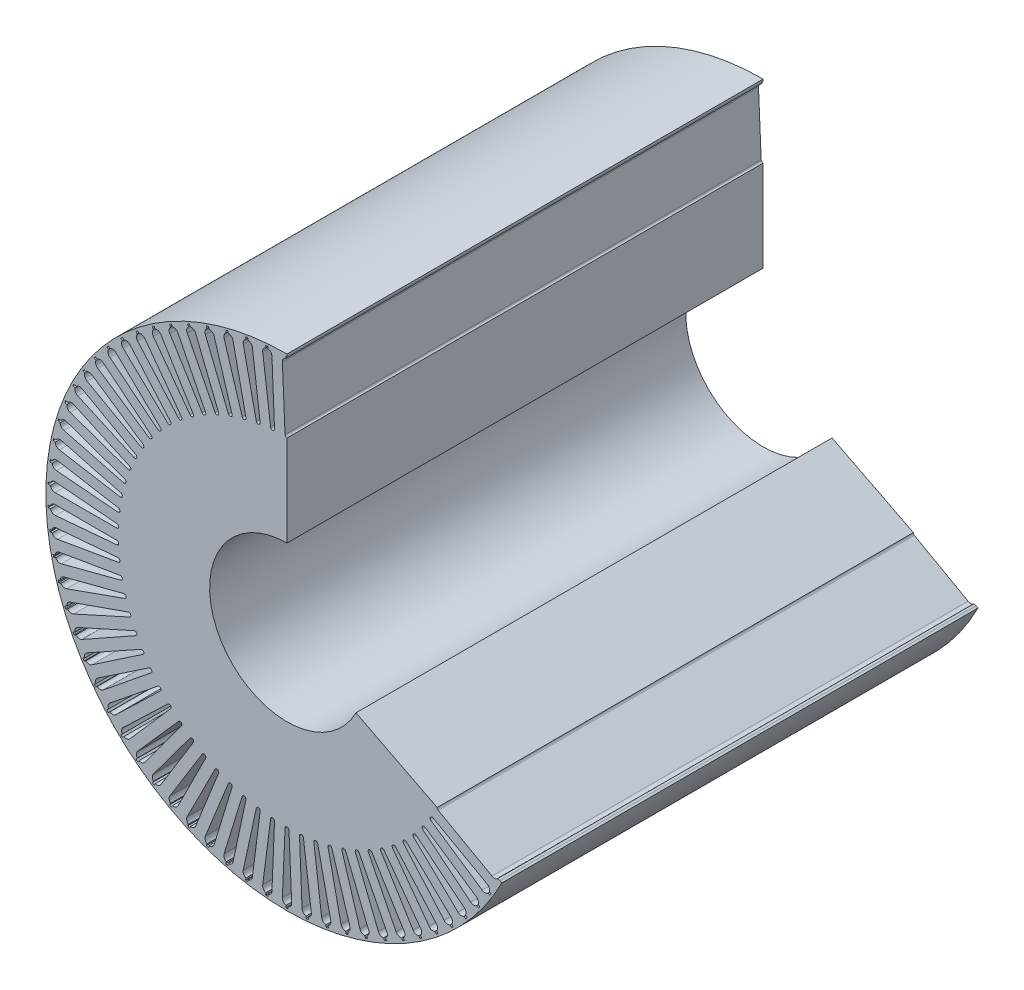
from build123d import *

# Parameters (mm, degrees)
SKICA1_R                 = 25
P_IDAT_VYSUNUT_M1_DEPTH  = 153.8
M_TKO1_SCALE             = 0.655
ODEBRAT_VYSUNUT_M1_DEPTH = 124.916687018


with BuildPart() as part:
    # Skica1 → P_idat vysunut_m1 (new body)
    with BuildSketch(Plane.XY):
        with BuildLine():
            ThreePointArc((77.9, 0), (55.083618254, 55.083618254), (0, 77.9))
            ThreePointArc((0, 77.9), (-55.083618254, -55.083618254), (77.9, 0))
        make_face()
        with BuildLine():
            ThreePointArc((-45.890654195, -59.220598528), (-45.928525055, -59.274358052), (-45.968708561, -59.326411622))
            ThreePointArc((-45.968708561, -59.326411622), (-46.805919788, -59.848414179), (-47.786517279, -59.739612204))
            Line((-47.786517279, -59.739612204), (-48.226271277, -60.284237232))
            Line((-48.226271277, -60.284237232), (-48.770896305, -59.844483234))
            Line((-48.770896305, -59.844483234), (-48.331142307, -59.299858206))
            ThreePointArc((-48.331142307, -59.299858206), (-48.644093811, -58.364192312), (-48.310190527, -57.435796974))
            ThreePointArc((-48.310190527, -57.435796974), (-48.267771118, -57.385548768), (-48.22319682, -57.337201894))
            Line((-48.22319682, -57.337201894), (-35.064014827, -42.42312779))
            ThreePointArc((-35.064014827, -42.42312779), (-34.178073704, -42.328743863), (-34.083689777, -43.214684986))
            Line((-34.083689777, -43.214684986), (-45.890654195, -59.220598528))
        make_face(mode=Mode.SUBTRACT)
        with BuildLine():
            ThreePointArc((-55.238888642, -50.613205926), (-55.285300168, -50.659791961), (-55.333702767, -50.704305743))
            ThreePointArc((-55.333702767, -50.704305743), (-56.247090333, -51.077310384), (-57.195195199, -50.804351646))
            Line((-57.195195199, -50.804351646), (-57.720665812, -51.266823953))
            Line((-57.720665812, -51.266823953), (-58.183138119, -50.741353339))
            Line((-58.183138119, -50.741353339), (-57.657667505, -50.278881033))
            ThreePointArc((-57.657667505, -50.278881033), (-57.807989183, -49.30378478), (-57.321989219, -48.445173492))
            ThreePointArc((-57.321989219, -48.445173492), (-57.271687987, -48.402816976), (-57.219584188, -48.36269862))
            Line((-57.219584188, -48.36269862), (-41.729194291, -35.887062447))
            ThreePointArc((-41.729194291, -35.887062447), (-40.840045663, -35.943760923), (-40.89674414, -36.832909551))
            Line((-40.89674414, -36.832909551), (-55.238888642, -50.613205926))
        make_face(mode=Mode.SUBTRACT)
        with BuildLine():
            ThreePointArc((-59.332189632, -45.746286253), (-59.382384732, -45.788768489), (-59.434387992, -45.829017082))
            ThreePointArc((-59.434387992, -45.829017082), (-60.376118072, -46.123217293), (-61.297658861, -45.770836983))
            Line((-61.297658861, -45.770836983), (-61.860456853, -46.187080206))
            Line((-61.860456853, -46.187080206), (-62.276700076, -45.624282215))
            Line((-62.276700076, -45.624282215), (-61.713902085, -45.208038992))
            ThreePointArc((-61.713902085, -45.208038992), (-61.780988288, -44.223707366), (-61.223923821, -43.409404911))
            ThreePointArc((-61.223923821, -43.409404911), (-61.170211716, -43.371466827), (-61.114893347, -43.335911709))
            Line((-61.114893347, -43.335911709), (-44.622299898, -32.218895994))
            ThreePointArc((-44.622299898, -32.218895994), (-43.741162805, -32.350795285), (-43.873062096, -33.231932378))
            Line((-43.873062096, -33.231932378), (-59.332189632, -45.746286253))
        make_face(mode=Mode.SUBTRACT)
        with BuildLine():
            ThreePointArc((-50.747590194, -55.11545629), (-50.78988375, -55.16581047), (-50.834336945, -55.214268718))
            ThreePointArc((-50.834336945, -55.214268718), (-51.712801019, -55.663390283), (-52.680638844, -55.471819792))
            Line((-52.680638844, -55.471819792), (-53.164996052, -55.977189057))
            Line((-53.164996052, -55.977189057), (-53.670365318, -55.492831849))
            Line((-53.670365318, -55.492831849), (-53.18600811, -54.987462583))
            ThreePointArc((-53.18600811, -54.987462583), (-53.418482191, -54.028627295), (-53.007048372, -53.131893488))
            ThreePointArc((-53.007048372, -53.131893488), (-52.960520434, -53.08542372), (-52.912006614, -53.04103118))
            Line((-52.912006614, -53.04103118), (-38.535428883, -39.296661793))
            ThreePointArc((-38.535428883, -39.296661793), (-37.644675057, -39.277750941), (-37.625764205, -40.168504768))
            Line((-37.625764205, -40.168504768), (-50.747590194, -55.11545629))
        make_face(mode=Mode.SUBTRACT)
        with BuildLine():
            ThreePointArc((-29.48760641, -68.873162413), (-29.510709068, -68.9347299), (-29.536479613, -68.995229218))
            ThreePointArc((-29.536479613, -68.995229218), (-30.215143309, -69.711347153), (-31.191515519, -69.853144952))
            Line((-31.191515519, -69.853144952), (-31.479846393, -70.491004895))
            Line((-31.479846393, -70.491004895), (-32.117706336, -70.202674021))
            Line((-32.117706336, -70.202674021), (-31.829375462, -69.564814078))
            ThreePointArc((-31.829375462, -69.564814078), (-32.367996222, -68.738196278), (-32.27880227, -67.755621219))
            ThreePointArc((-32.27880227, -67.755621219), (-32.250413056, -67.696305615), (-32.21945939, -67.638287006))
            Line((-32.21945939, -67.638287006), (-23.242904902, -49.889620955))
            ThreePointArc((-23.242904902, -49.889620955), (-22.409333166, -49.575044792), (-22.094757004, -50.408616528))
            Line((-22.094757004, -50.408616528), (-29.48760641, -68.873162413))
        make_face(mode=Mode.SUBTRACT)
        with BuildLine():
            ThreePointArc((-23.54052476, -71.125769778), (-23.558322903, -71.189074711), (-23.578869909, -71.251541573))
            ThreePointArc((-23.578869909, -71.251541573), (-24.194357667, -72.022634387), (-25.155187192, -72.246723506))
            Line((-25.155187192, -72.246723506), (-25.388385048, -72.906737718))
            Line((-25.388385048, -72.906737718), (-26.04839926, -72.673539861))
            Line((-26.04839926, -72.673539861), (-25.815201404, -72.01352565))
            ThreePointArc((-25.815201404, -72.01352565), (-26.421983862, -71.235563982), (-26.416439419, -70.248964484))
            ThreePointArc((-26.416439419, -70.248964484), (-26.393182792, -70.187454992), (-26.367260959, -70.127020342))
            Line((-26.367260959, -70.127020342), (-18.928236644, -51.681029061))
            ThreePointArc((-18.928236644, -51.681029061), (-18.124345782, -51.296894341), (-17.740211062, -52.100785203))
            Line((-17.740211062, -52.100785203), (-23.54052476, -71.125769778))
        make_face(mode=Mode.SUBTRACT)
        with BuildLine():
            ThreePointArc((-17.42383309, -72.865914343), (-17.436198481, -72.930500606), (-17.451373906, -72.994484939))
            ThreePointArc((-17.451373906, -72.994484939), (-17.999251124, -73.814996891), (-18.937615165, -74.119762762))
            Line((-18.937615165, -74.119762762), (-19.113999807, -74.797175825))
            Line((-19.113999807, -74.797175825), (-19.79141287, -74.620791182))
            Line((-19.79141287, -74.620791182), (-19.615028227, -73.943378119))
            ThreePointArc((-19.615028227, -73.943378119), (-20.285600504, -73.219677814), (-20.363745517, -72.236162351))
            ThreePointArc((-20.363745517, -72.236162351), (-20.345789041, -72.172902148), (-20.325085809, -72.110486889))
            Line((-20.325085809, -72.110486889), (-14.477190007, -53.100074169))
            ThreePointArc((-14.477190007, -53.100074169), (-13.708772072, -52.649148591), (-13.257846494, -53.417566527))
            Line((-13.257846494, -53.417566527), (-17.42383309, -72.865914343))
        make_face(mode=Mode.SUBTRACT)
        with BuildLine():
            ThreePointArc((-11.181602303, -74.081058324), (-11.18844585, -74.146460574), (-11.198140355, -74.211501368))
            ThreePointArc((-11.198140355, -74.211501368), (-11.674459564, -75.07552065), (-12.583597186, -75.458767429))
            Line((-12.583597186, -75.458767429), (-12.70189776, -76.148698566))
            Line((-12.70189776, -76.148698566), (-13.391828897, -76.030397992))
            Line((-13.391828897, -76.030397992), (-13.273528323, -75.340466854))
            ThreePointArc((-13.273528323, -75.340466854), (-14.003058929, -74.67624219), (-14.164330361, -73.702897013))
            ThreePointArc((-14.164330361, -73.702897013), (-14.151803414, -73.63834189), (-14.136467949, -73.574395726))
            Line((-14.136467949, -73.574395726), (-9.921834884, -54.136532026))
            ThreePointArc((-9.921834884, -54.136532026), (-9.194426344, -53.622064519), (-8.679958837, -54.34947306))
            Line((-8.679958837, -54.34947306), (-11.181602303, -74.081058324))
        make_face(mode=Mode.SUBTRACT)
        with BuildLine():
            ThreePointArc((-4.858807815, -74.762446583), (-4.86008021, -74.828193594), (-4.864223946, -74.893822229))
            ThreePointArc((-4.864223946, -74.893822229), (-5.265553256, -75.795123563), (-6.138914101, -76.254089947))
            Line((-6.138914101, -76.254089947), (-6.198278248, -76.951568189))
            Line((-6.198278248, -76.951568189), (-6.89575649, -76.892204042))
            Line((-6.89575649, -76.892204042), (-6.836392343, -76.1947258))
            ThreePointArc((-6.836392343, -76.1947258), (-7.619624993, -75.59476253), (-7.862860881, -74.638600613))
            ThreePointArc((-7.862860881, -74.638600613), (-7.85585372, -74.573215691), (-7.845996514, -74.508199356))
            Line((-7.845996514, -74.508199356), (-5.294992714, -54.782934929))
            ThreePointArc((-5.294992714, -54.782934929), (-4.613834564, -54.208632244), (-4.039531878, -54.889790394))
            Line((-4.039531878, -54.889790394), (-4.858807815, -74.762446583))
        make_face(mode=Mode.SUBTRACT)
        with BuildLine():
            ThreePointArc((-40.703074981, -62.899054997), (-40.736250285, -62.955832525), (-40.771874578, -63.011106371))
            ThreePointArc((-40.771874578, -63.011106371), (-41.561800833, -63.60222888), (-42.548092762, -63.576979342))
            Line((-42.548092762, -63.576979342), (-42.940075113, -64.156936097))
            Line((-42.940075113, -64.156936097), (-43.520031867, -63.764953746))
            Line((-43.520031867, -63.764953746), (-43.128049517, -63.184996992))
            ThreePointArc((-43.128049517, -63.184996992), (-43.519223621, -62.279241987), (-43.265256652, -61.325874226))
            ThreePointArc((-43.265256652, -61.325874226), (-43.227251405, -61.272209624), (-43.186937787, -61.220256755))
            Line((-43.186937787, -61.220256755), (-31.339963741, -45.243934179))
            ThreePointArc((-31.339963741, -45.243934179), (-30.465218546, -45.074757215), (-30.296041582, -45.94950241))
            Line((-30.296041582, -45.94950241), (-40.703074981, -62.899054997))
        make_face(mode=Mode.SUBTRACT)
        with BuildLine():
            ThreePointArc((-35.22222918, -66.124322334), (-35.250469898, -66.183708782), (-35.281278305, -66.241804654))
            ThreePointArc((-35.281278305, -66.241804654), (-36.01822815, -66.897788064), (-37.003108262, -66.956272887))
            Line((-37.003108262, -66.956272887), (-37.344494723, -67.567382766))
            Line((-37.344494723, -67.567382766), (-37.955604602, -67.225996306))
            Line((-37.955604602, -67.225996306), (-37.614218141, -66.614886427))
            ThreePointArc((-37.614218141, -66.614886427), (-38.080796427, -65.745568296), (-37.908595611, -64.77409715))
            ThreePointArc((-37.908595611, -64.77409715), (-37.875278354, -64.717402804), (-37.839515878, -64.662218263))
            Line((-37.839515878, -64.662218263), (-27.390107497, -47.738756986))
            ThreePointArc((-27.390107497, -47.738756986), (-26.532860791, -47.496005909), (-26.290109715, -48.353252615))
            Line((-26.290109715, -48.353252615), (-35.22222918, -66.124322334))
        make_face(mode=Mode.SUBTRACT)
        with BuildLine():
            ThreePointArc((-66.209910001, -35.061078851), (-66.266562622, -35.094467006), (-66.324619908, -35.125348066))
            ThreePointArc((-66.324619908, -35.125348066), (-67.302524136, -35.256163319), (-68.151256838, -34.753110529))
            Line((-68.151256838, -34.753110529), (-68.776304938, -35.06825315))
            Line((-68.776304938, -35.06825315), (-69.09144756, -34.44320505))
            Line((-69.09144756, -34.44320505), (-68.466399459, -34.128062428))
            ThreePointArc((-68.466399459, -34.128062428), (-68.366167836, -33.146551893), (-67.679498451, -32.43810679))
            ThreePointArc((-67.679498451, -32.43810679), (-67.620147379, -32.409791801), (-67.55961587, -32.384096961))
            Line((-67.55961587, -32.384096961), (-49.425468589, -24.214251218))
            ThreePointArc((-49.425468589, -24.214251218), (-48.579296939, -24.493166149), (-48.85821187, -25.339337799))
            Line((-48.85821187, -25.339337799), (-66.209910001, -35.061078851))
        make_face(mode=Mode.SUBTRACT)
        with BuildLine():
            ThreePointArc((-68.944775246, -29.319778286), (-69.004055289, -29.348241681), (-69.06452232, -29.37408789))
            ThreePointArc((-69.06452232, -29.37408789), (-70.049997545, -29.421499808), (-70.853010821, -28.84828171))
            Line((-70.853010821, -28.84828171), (-71.50253314, -29.109281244))
            Line((-71.50253314, -29.109281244), (-71.763532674, -28.459758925))
            Line((-71.763532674, -28.459758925), (-71.114010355, -28.198759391))
            ThreePointArc((-71.114010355, -28.198759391), (-70.93090191, -27.229284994), (-70.186625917, -26.581625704))
            ThreePointArc((-70.186625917, -26.581625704), (-70.125087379, -26.558446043), (-70.062594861, -26.537977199))
            Line((-70.062594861, -26.537977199), (-51.300924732, -19.935446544))
            ThreePointArc((-51.300924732, -19.935446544), (-50.481455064, -20.28511705), (-50.83112557, -21.104586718))
            Line((-50.83112557, -21.104586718), (-68.944775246, -29.319778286))
        make_face(mode=Mode.SUBTRACT)
        with BuildLine():
            ThreePointArc((-71.182891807, -23.367228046), (-71.244372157, -23.390561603), (-71.306813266, -23.411186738))
            ThreePointArc((-71.306813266, -23.411186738), (-72.292759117, -23.374853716), (-73.044267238, -22.73560036))
            Line((-73.044267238, -22.73560036), (-73.713583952, -22.9405763))
            Line((-73.713583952, -22.9405763), (-73.918559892, -22.271259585))
            Line((-73.918559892, -22.271259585), (-73.249243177, -22.066283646))
            ThreePointArc((-73.249243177, -22.066283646), (-72.98457721, -21.115830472), (-72.188057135, -20.533623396))
            ThreePointArc((-72.188057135, -20.533623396), (-72.124774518, -20.515746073), (-72.060771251, -20.500650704))
            Line((-72.060771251, -20.500650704), (-52.806756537, -15.513006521))
            ThreePointArc((-52.806756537, -15.513006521), (-52.019893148, -15.930913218), (-52.437799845, -16.717776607))
            Line((-52.437799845, -16.717776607), (-71.182891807, -23.367228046))
        make_face(mode=Mode.SUBTRACT)
        with BuildLine():
            ThreePointArc((-62.998000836, -40.54976354), (-63.051617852, -40.587835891), (-63.10684709, -40.623529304))
            ThreePointArc((-63.10684709, -40.623529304), (-64.070134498, -40.836805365), (-64.958471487, -40.40754239))
            Line((-64.958471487, -40.40754239), (-65.554541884, -40.774557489))
            Line((-65.554541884, -40.774557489), (-65.921556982, -40.178487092))
            Line((-65.921556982, -40.178487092), (-65.325486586, -39.811471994))
            ThreePointArc((-65.325486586, -39.811471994), (-65.308853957, -38.824997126), (-64.684738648, -38.060870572))
            ThreePointArc((-64.684738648, -38.060870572), (-64.628002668, -38.027624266), (-64.569868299, -37.996888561))
            Line((-64.569868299, -37.996888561), (-47.193900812, -28.318591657))
            ThreePointArc((-47.193900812, -28.318591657), (-46.327123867, -28.524741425), (-46.533273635, -29.39151837))
            Line((-46.533273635, -29.39151837), (-62.998000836, -40.54976354))
        make_face(mode=Mode.SUBTRACT)
        with BuildLine():
            ThreePointArc((-72.908134, -17.246316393), (-72.971371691, -17.264351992), (-73.035336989, -17.279607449))
            ThreePointArc((-73.035336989, -17.279607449), (-74.014649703, -17.159791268), (-74.709238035, -16.459108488))
            Line((-74.709238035, -16.459108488), (-75.393526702, -16.606583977))
            Line((-75.393526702, -16.606583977), (-75.541002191, -15.92229531))
            Line((-75.541002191, -15.92229531), (-74.856713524, -15.774819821))
            ThreePointArc((-74.856713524, -15.774819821), (-74.512396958, -14.850235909), (-73.669371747, -14.337675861))
            ThreePointArc((-73.669371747, -14.337675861), (-73.604801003, -14.325229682), (-73.539748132, -14.31561655))
            Line((-73.539748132, -14.31561655), (-53.932114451, -10.978794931))
            ThreePointArc((-53.932114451, -10.978794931), (-53.18352671, -11.461926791), (-53.666658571, -12.210514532))
            Line((-53.666658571, -12.210514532), (-72.908134, -17.246316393))
        make_face(mode=Mode.SUBTRACT)
        with BuildLine():
            ThreePointArc((-74.108071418, -11.001144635), (-74.172610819, -11.01375233), (-74.237639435, -11.023528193))
            ThreePointArc((-74.237639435, -11.023528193), (-75.203263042, -10.821092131), (-75.83592706, -10.064028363))
            Line((-75.83592706, -10.064028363), (-76.530257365, -10.152940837))
            Line((-76.530257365, -10.152940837), (-76.619169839, -9.458610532))
            Line((-76.619169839, -9.458610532), (-75.924839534, -9.369698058))
            ThreePointArc((-75.924839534, -9.369698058), (-75.503353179, -8.477645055), (-74.619896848, -8.038425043))
            ThreePointArc((-74.619896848, -8.038425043), (-74.554503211, -8.031499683), (-74.488869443, -8.027438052))
            Line((-74.488869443, -8.027438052), (-54.668890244, -6.365480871))
            ThreePointArc((-54.668890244, -6.365480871), (-53.963971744, -6.910356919), (-54.508847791, -7.61527542))
            Line((-54.508847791, -7.61527542), (-74.108071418, -11.001144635))
        make_face(mode=Mode.SUBTRACT)
        with BuildLine():
            ThreePointArc((-74.774058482, -4.676709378), (-74.839434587, -4.68379833), (-74.905057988, -4.688024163))
            ThreePointArc((-74.905057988, -4.688024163), (-75.850035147, -4.404426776), (-76.416216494, -3.596436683))
            Line((-76.416216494, -3.596436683), (-77.11558577, -3.626145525))
            Line((-77.11558577, -3.626145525), (-77.145294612, -2.926776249))
            Line((-77.145294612, -2.926776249), (-76.445925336, -2.897067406))
            ThreePointArc((-76.445925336, -2.897067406), (-75.950306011, -2.043972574), (-75.032783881, -1.681257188))
            ThreePointArc((-75.032783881, -1.681257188), (-74.967038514, -1.679902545), (-74.901296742, -1.681421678))
            Line((-74.901296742, -1.681421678), (-55.011775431, -1.706303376))
            ThreePointArc((-55.011775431, -1.706303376), (-54.355605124, -2.308997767), (-54.958299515, -2.965168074))
            Line((-54.958299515, -2.965168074), (-74.774058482, -4.676709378))
        make_face(mode=Mode.SUBTRACT)
        with BuildLine():
            ThreePointArc((1.498994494, -74.905169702), (1.503302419, -74.970787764), (1.504739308, -75.036531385))
            ThreePointArc((1.504739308, -75.036531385), (1.181291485, -75.968620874), (0.35, -76.5))
            Line((0.35, -76.5), (0.35, -77.2))
            Line((0.35, -77.2), (-0.35, -77.2))
            Line((-0.35, -77.2), (-0.35, -76.5))
            ThreePointArc((-0.35, -76.5), (-1.181291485, -75.968620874), (-1.504739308, -75.036531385))
            ThreePointArc((-1.504739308, -75.036531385), (-1.503302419, -74.970787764), (-1.498994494, -74.905169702))
            Line((-1.498994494, -74.905169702), (-0.63, -55.03462553))
            ThreePointArc((-0.63, -55.03462553), (0, -54.40462553), (0.63, -55.03462553))
            Line((0.63, -55.03462553), (1.498994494, -74.905169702))
        make_face(mode=Mode.SUBTRACT)
        with BuildLine():
            ThreePointArc((7.845996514, -74.508199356), (7.85585372, -74.573215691), (7.862860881, -74.638600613))
            ThreePointArc((7.862860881, -74.638600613), (7.619624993, -75.59476253), (6.836392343, -76.1947258))
            Line((6.836392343, -76.1947258), (6.895756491, -76.892204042))
            Line((6.895756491, -76.892204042), (6.198278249, -76.951568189))
            Line((6.198278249, -76.951568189), (6.138914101, -76.254089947))
            ThreePointArc((6.138914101, -76.254089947), (5.265553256, -75.795123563), (4.864223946, -74.893822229))
            ThreePointArc((4.864223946, -74.893822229), (4.86008021, -74.828193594), (4.858807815, -74.762446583))
            Line((4.858807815, -74.762446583), (4.039531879, -54.889790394))
            ThreePointArc((4.039531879, -54.889790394), (4.613834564, -54.208632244), (5.294992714, -54.782934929))
            Line((5.294992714, -54.782934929), (7.845996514, -74.508199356))
        make_face(mode=Mode.SUBTRACT)
        with BuildLine():
            ThreePointArc((14.136467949, -73.574395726), (14.151803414, -73.63834189), (14.164330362, -73.702897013))
            ThreePointArc((14.164330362, -73.702897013), (14.003058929, -74.67624219), (13.273528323, -75.340466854))
            Line((13.273528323, -75.340466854), (13.391828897, -76.030397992))
            Line((13.391828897, -76.030397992), (12.70189776, -76.148698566))
            Line((12.70189776, -76.148698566), (12.583597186, -75.458767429))
            ThreePointArc((12.583597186, -75.458767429), (11.674459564, -75.07552065), (11.198140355, -74.211501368))
            ThreePointArc((11.198140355, -74.211501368), (11.18844585, -74.146460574), (11.181602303, -74.081058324))
            Line((11.181602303, -74.081058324), (8.679958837, -54.34947306))
            ThreePointArc((8.679958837, -54.34947306), (9.194426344, -53.622064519), (9.921834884, -54.136532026))
            Line((9.921834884, -54.136532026), (14.136467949, -73.574395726))
        make_face(mode=Mode.SUBTRACT)
        with BuildLine():
            ThreePointArc((20.325085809, -72.110486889), (20.345789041, -72.172902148), (20.363745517, -72.236162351))
            ThreePointArc((20.363745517, -72.236162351), (20.285600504, -73.219677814), (19.615028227, -73.943378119))
            Line((19.615028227, -73.943378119), (19.79141287, -74.620791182))
            Line((19.79141287, -74.620791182), (19.113999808, -74.797175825))
            Line((19.113999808, -74.797175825), (18.937615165, -74.119762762))
            ThreePointArc((18.937615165, -74.119762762), (17.999251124, -73.814996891), (17.451373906, -72.994484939))
            ThreePointArc((17.451373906, -72.994484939), (17.436198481, -72.930500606), (17.42383309, -72.865914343))
            Line((17.42383309, -72.865914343), (13.257846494, -53.417566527))
            ThreePointArc((13.257846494, -53.417566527), (13.708772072, -52.649148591), (14.477190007, -53.100074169))
            Line((14.477190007, -53.100074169), (20.325085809, -72.110486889))
        make_face(mode=Mode.SUBTRACT)
        with BuildLine():
            ThreePointArc((26.367260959, -70.127020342), (26.393182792, -70.187454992), (26.416439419, -70.248964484))
            ThreePointArc((26.416439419, -70.248964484), (26.421983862, -71.235563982), (25.815201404, -72.01352565))
            Line((25.815201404, -72.01352565), (26.04839926, -72.673539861))
            Line((26.04839926, -72.673539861), (25.388385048, -72.906737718))
            Line((25.388385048, -72.906737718), (25.155187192, -72.246723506))
            ThreePointArc((25.155187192, -72.246723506), (24.194357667, -72.022634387), (23.578869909, -71.251541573))
            ThreePointArc((23.578869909, -71.251541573), (23.558322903, -71.189074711), (23.54052476, -71.125769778))
            Line((23.54052476, -71.125769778), (17.740211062, -52.100785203))
            ThreePointArc((17.740211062, -52.100785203), (18.124345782, -51.296894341), (18.928236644, -51.681029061))
            Line((18.928236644, -51.681029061), (26.367260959, -70.127020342))
        make_face(mode=Mode.SUBTRACT)
        with BuildLine():
            ThreePointArc((32.21945939, -67.638287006), (32.250413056, -67.696305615), (32.27880227, -67.755621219))
            ThreePointArc((32.27880227, -67.755621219), (32.367996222, -68.738196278), (31.829375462, -69.564814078))
            Line((31.829375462, -69.564814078), (32.117706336, -70.202674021))
            Line((32.117706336, -70.202674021), (31.479846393, -70.491004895))
            Line((31.479846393, -70.491004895), (31.191515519, -69.853144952))
            ThreePointArc((31.191515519, -69.853144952), (30.215143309, -69.711347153), (29.536479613, -68.995229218))
            ThreePointArc((29.536479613, -68.995229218), (29.510709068, -68.9347299), (29.48760641, -68.873162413))
            Line((29.48760641, -68.873162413), (22.094757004, -50.408616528))
            ThreePointArc((22.094757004, -50.408616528), (22.409333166, -49.575044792), (23.242904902, -49.889620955))
            Line((23.242904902, -49.889620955), (32.21945939, -67.638287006))
        make_face(mode=Mode.SUBTRACT)
        with BuildLine():
            ThreePointArc((37.839515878, -64.662218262), (37.875278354, -64.717402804), (37.908595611, -64.77409715))
            ThreePointArc((37.908595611, -64.77409715), (38.080796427, -65.745568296), (37.614218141, -66.614886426))
            Line((37.614218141, -66.614886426), (37.955604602, -67.225996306))
            Line((37.955604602, -67.225996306), (37.344494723, -67.567382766))
            Line((37.344494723, -67.567382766), (37.003108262, -66.956272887))
            ThreePointArc((37.003108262, -66.956272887), (36.018228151, -66.897788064), (35.281278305, -66.241804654))
            ThreePointArc((35.281278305, -66.241804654), (35.250469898, -66.183708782), (35.22222918, -66.124322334))
            Line((35.22222918, -66.124322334), (26.290109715, -48.353252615))
            ThreePointArc((26.290109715, -48.353252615), (26.532860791, -47.496005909), (27.390107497, -47.738756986))
            Line((27.390107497, -47.738756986), (37.839515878, -64.662218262))
        make_face(mode=Mode.SUBTRACT)
        with BuildLine():
            ThreePointArc((43.186937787, -61.220256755), (43.227251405, -61.272209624), (43.265256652, -61.325874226))
            ThreePointArc((43.265256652, -61.325874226), (43.519223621, -62.279241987), (43.128049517, -63.184996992))
            Line((43.128049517, -63.184996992), (43.520031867, -63.764953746))
            Line((43.520031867, -63.764953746), (42.940075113, -64.156936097))
            Line((42.940075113, -64.156936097), (42.548092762, -63.576979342))
            ThreePointArc((42.548092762, -63.576979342), (41.561800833, -63.60222888), (40.771874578, -63.011106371))
            ThreePointArc((40.771874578, -63.011106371), (40.736250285, -62.955832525), (40.703074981, -62.899054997))
            Line((40.703074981, -62.899054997), (30.296041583, -45.94950241))
            ThreePointArc((30.296041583, -45.94950241), (30.465218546, -45.074757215), (31.339963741, -45.243934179))
            Line((31.339963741, -45.243934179), (43.186937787, -61.220256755))
        make_face(mode=Mode.SUBTRACT)
        with BuildLine():
            ThreePointArc((48.22319682, -57.337201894), (48.267771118, -57.385548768), (48.310190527, -57.435796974))
            ThreePointArc((48.310190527, -57.435796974), (48.644093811, -58.364192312), (48.331142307, -59.299858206))
            Line((48.331142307, -59.299858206), (48.770896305, -59.844483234))
            Line((48.770896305, -59.844483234), (48.226271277, -60.284237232))
            Line((48.226271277, -60.284237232), (47.786517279, -59.739612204))
            ThreePointArc((47.786517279, -59.739612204), (46.805919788, -59.848414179), (45.968708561, -59.326411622))
            ThreePointArc((45.968708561, -59.326411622), (45.928525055, -59.274358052), (45.890654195, -59.220598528))
            Line((45.890654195, -59.220598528), (34.083689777, -43.214684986))
            ThreePointArc((34.083689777, -43.214684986), (34.178073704, -42.328743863), (35.064014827, -42.42312779))
            Line((35.064014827, -42.42312779), (48.22319682, -57.337201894))
        make_face(mode=Mode.SUBTRACT)
        with BuildLine():
            ThreePointArc((52.912006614, -53.04103118), (52.960520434, -53.08542372), (53.007048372, -53.131893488))
            ThreePointArc((53.007048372, -53.131893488), (53.418482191, -54.028627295), (53.18600811, -54.987462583))
            Line((53.18600811, -54.987462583), (53.670365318, -55.492831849))
            Line((53.670365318, -55.492831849), (53.164996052, -55.977189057))
            Line((53.164996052, -55.977189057), (52.680638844, -55.471819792))
            ThreePointArc((52.680638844, -55.471819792), (51.712801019, -55.663390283), (50.834336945, -55.214268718))
            ThreePointArc((50.834336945, -55.214268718), (50.78988375, -55.16581047), (50.747590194, -55.11545629))
            Line((50.747590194, -55.11545629), (37.625764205, -40.168504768))
            ThreePointArc((37.625764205, -40.168504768), (37.644675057, -39.277750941), (38.535428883, -39.296661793))
            Line((38.535428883, -39.296661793), (52.912006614, -53.04103118))
        make_face(mode=Mode.SUBTRACT)
        with BuildLine():
            ThreePointArc((57.219584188, -48.36269862), (57.271687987, -48.402816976), (57.32198922, -48.445173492))
            ThreePointArc((57.32198922, -48.445173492), (57.807989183, -49.30378478), (57.657667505, -50.278881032))
            Line((57.657667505, -50.278881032), (58.183138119, -50.741353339))
            Line((58.183138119, -50.741353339), (57.720665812, -51.266823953))
            Line((57.720665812, -51.266823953), (57.195195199, -50.804351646))
            ThreePointArc((57.195195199, -50.804351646), (56.247090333, -51.077310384), (55.333702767, -50.704305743))
            ThreePointArc((55.333702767, -50.704305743), (55.285300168, -50.659791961), (55.238888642, -50.613205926))
            Line((55.238888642, -50.613205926), (40.89674414, -36.832909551))
            ThreePointArc((40.89674414, -36.832909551), (40.840045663, -35.943760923), (41.729194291, -35.887062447))
            Line((41.729194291, -35.887062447), (57.219584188, -48.36269862))
        make_face(mode=Mode.SUBTRACT)
        with BuildLine():
            ThreePointArc((61.114893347, -43.335911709), (61.170211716, -43.371466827), (61.223923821, -43.409404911))
            ThreePointArc((61.223923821, -43.409404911), (61.780988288, -44.223707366), (61.713902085, -45.208038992))
            Line((61.713902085, -45.208038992), (62.276700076, -45.624282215))
            Line((62.276700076, -45.624282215), (61.860456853, -46.187080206))
            Line((61.860456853, -46.187080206), (61.297658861, -45.770836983))
            ThreePointArc((61.297658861, -45.770836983), (60.376118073, -46.123217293), (59.434387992, -45.829017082))
            ThreePointArc((59.434387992, -45.829017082), (59.382384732, -45.788768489), (59.332189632, -45.746286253))
            Line((59.332189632, -45.746286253), (43.873062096, -33.231932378))
            ThreePointArc((43.873062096, -33.231932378), (43.741162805, -32.350795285), (44.622299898, -32.218895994))
            Line((44.622299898, -32.218895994), (61.114893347, -43.335911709))
        make_face(mode=Mode.SUBTRACT)
        with BuildLine():
            ThreePointArc((64.569868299, -37.996888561), (64.628002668, -38.027624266), (64.684738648, -38.060870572))
            ThreePointArc((64.684738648, -38.060870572), (65.308853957, -38.824997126), (65.325486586, -39.811471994))
            Line((65.325486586, -39.811471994), (65.921556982, -40.178487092))
            Line((65.921556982, -40.178487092), (65.554541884, -40.774557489))
            Line((65.554541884, -40.774557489), (64.958471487, -40.40754239))
            ThreePointArc((64.958471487, -40.40754239), (64.070134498, -40.836805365), (63.10684709, -40.623529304))
            ThreePointArc((63.10684709, -40.623529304), (63.051617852, -40.587835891), (62.998000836, -40.54976354))
            Line((62.998000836, -40.54976354), (46.533273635, -29.39151837))
            ThreePointArc((46.533273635, -29.39151837), (46.327123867, -28.524741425), (47.193900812, -28.318591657))
            Line((47.193900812, -28.318591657), (64.569868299, -37.996888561))
        make_face(mode=Mode.SUBTRACT)
        with BuildLine():
            ThreePointArc((67.559615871, -32.384096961), (67.620147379, -32.409791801), (67.679498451, -32.43810679))
            ThreePointArc((67.679498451, -32.43810679), (68.366167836, -33.146551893), (68.466399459, -34.128062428))
            Line((68.466399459, -34.128062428), (69.09144756, -34.44320505))
            Line((69.09144756, -34.44320505), (68.776304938, -35.06825315))
            Line((68.776304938, -35.06825315), (68.151256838, -34.753110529))
            ThreePointArc((68.151256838, -34.753110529), (67.302524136, -35.256163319), (66.324619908, -35.125348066))
            ThreePointArc((66.324619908, -35.125348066), (66.266562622, -35.094467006), (66.209910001, -35.061078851))
            Line((66.209910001, -35.061078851), (48.85821187, -25.339337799))
            ThreePointArc((48.85821187, -25.339337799), (48.579296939, -24.493166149), (49.425468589, -24.214251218))
            Line((49.425468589, -24.214251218), (67.559615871, -32.384096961))
        make_face(mode=Mode.SUBTRACT)
        with BuildLine():
            ThreePointArc((70.062594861, -26.537977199), (70.125087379, -26.558446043), (70.186625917, -26.581625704))
            ThreePointArc((70.186625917, -26.581625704), (70.93090191, -27.229284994), (71.114010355, -28.198759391))
            Line((71.114010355, -28.198759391), (71.763532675, -28.459758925))
            Line((71.763532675, -28.459758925), (71.50253314, -29.109281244))
            Line((71.50253314, -29.109281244), (70.853010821, -28.84828171))
            ThreePointArc((70.853010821, -28.84828171), (70.049997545, -29.421499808), (69.06452232, -29.37408789))
            ThreePointArc((69.06452232, -29.37408789), (69.004055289, -29.348241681), (68.944775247, -29.319778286))
            Line((68.944775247, -29.319778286), (50.83112557, -21.104586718))
            ThreePointArc((50.83112557, -21.104586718), (50.481455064, -20.28511705), (51.300924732, -19.935446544))
            Line((51.300924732, -19.935446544), (70.062594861, -26.537977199))
        make_face(mode=Mode.SUBTRACT)
        with BuildLine():
            ThreePointArc((72.060771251, -20.500650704), (72.124774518, -20.515746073), (72.188057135, -20.533623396))
            ThreePointArc((72.188057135, -20.533623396), (72.98457721, -21.115830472), (73.249243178, -22.066283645))
            Line((73.249243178, -22.066283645), (73.918559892, -22.271259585))
            Line((73.918559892, -22.271259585), (73.713583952, -22.9405763))
            Line((73.713583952, -22.9405763), (73.044267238, -22.73560036))
            ThreePointArc((73.044267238, -22.73560036), (72.292759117, -23.374853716), (71.306813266, -23.411186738))
            ThreePointArc((71.306813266, -23.411186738), (71.244372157, -23.390561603), (71.182891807, -23.367228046))
            Line((71.182891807, -23.367228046), (52.437799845, -16.717776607))
            ThreePointArc((52.437799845, -16.717776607), (52.019893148, -15.930913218), (52.806756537, -15.513006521))
            Line((52.806756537, -15.513006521), (72.060771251, -20.500650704))
        make_face(mode=Mode.SUBTRACT)
        with BuildLine():
            ThreePointArc((73.539748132, -14.31561655), (73.604801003, -14.325229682), (73.669371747, -14.337675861))
            ThreePointArc((73.669371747, -14.337675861), (74.512396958, -14.850235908), (74.856713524, -15.774819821))
            Line((74.856713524, -15.774819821), (75.541002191, -15.92229531))
            Line((75.541002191, -15.92229531), (75.393526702, -16.606583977))
            Line((75.393526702, -16.606583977), (74.709238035, -16.459108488))
            ThreePointArc((74.709238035, -16.459108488), (74.014649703, -17.159791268), (73.035336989, -17.279607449))
            ThreePointArc((73.035336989, -17.279607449), (72.971371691, -17.264351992), (72.908134, -17.246316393))
            Line((72.908134, -17.246316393), (53.666658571, -12.210514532))
            ThreePointArc((53.666658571, -12.210514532), (53.18352671, -11.461926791), (53.932114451, -10.978794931))
            Line((53.932114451, -10.978794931), (73.539748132, -14.31561655))
        make_face(mode=Mode.SUBTRACT)
        with BuildLine():
            ThreePointArc((74.488869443, -8.027438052), (74.554503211, -8.031499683), (74.619896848, -8.038425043))
            ThreePointArc((74.619896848, -8.038425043), (75.503353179, -8.477645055), (75.924839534, -9.369698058))
            Line((75.924839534, -9.369698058), (76.619169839, -9.458610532))
            Line((76.619169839, -9.458610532), (76.530257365, -10.152940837))
            Line((76.530257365, -10.152940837), (75.83592706, -10.064028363))
            ThreePointArc((75.83592706, -10.064028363), (75.203263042, -10.82109213), (74.237639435, -11.023528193))
            ThreePointArc((74.237639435, -11.023528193), (74.172610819, -11.01375233), (74.108071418, -11.001144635))
            Line((74.108071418, -11.001144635), (54.508847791, -7.61527542))
            ThreePointArc((54.508847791, -7.61527542), (53.963971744, -6.910356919), (54.668890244, -6.365480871))
            Line((54.668890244, -6.365480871), (74.488869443, -8.027438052))
        make_face(mode=Mode.SUBTRACT)
        with BuildLine():
            ThreePointArc((74.901296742, -1.681421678), (74.967038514, -1.679902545), (75.032783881, -1.681257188))
            ThreePointArc((75.032783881, -1.681257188), (75.950306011, -2.043972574), (76.445925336, -2.897067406))
            Line((76.445925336, -2.897067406), (77.145294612, -2.926776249))
            Line((77.145294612, -2.926776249), (77.11558577, -3.626145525))
            Line((77.11558577, -3.626145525), (76.416216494, -3.596436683))
            ThreePointArc((76.416216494, -3.596436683), (75.850035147, -4.404426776), (74.905057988, -4.688024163))
            ThreePointArc((74.905057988, -4.688024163), (74.839434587, -4.68379833), (74.774058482, -4.676709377))
            Line((74.774058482, -4.676709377), (54.958299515, -2.965168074))
            ThreePointArc((54.958299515, -2.965168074), (54.355605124, -2.308997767), (55.011775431, -1.706303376))
            Line((55.011775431, -1.706303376), (74.901296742, -1.681421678))
        make_face(mode=Mode.SUBTRACT)
        with BuildLine():
            ThreePointArc((-74.901296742, 1.681421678), (-74.967038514, 1.679902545), (-75.032783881, 1.681257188))
            ThreePointArc((-75.032783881, 1.681257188), (-75.950306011, 2.043972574), (-76.445925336, 2.897067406))
            Line((-76.445925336, 2.897067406), (-77.145294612, 2.926776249))
            Line((-77.145294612, 2.926776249), (-77.11558577, 3.626145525))
            Line((-77.11558577, 3.626145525), (-76.416216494, 3.596436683))
            ThreePointArc((-76.416216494, 3.596436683), (-75.850035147, 4.404426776), (-74.905057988, 4.688024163))
            ThreePointArc((-74.905057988, 4.688024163), (-74.839434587, 4.68379833), (-74.774058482, 4.676709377))
            Line((-74.774058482, 4.676709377), (-54.958299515, 2.965168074))
            ThreePointArc((-54.958299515, 2.965168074), (-54.355605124, 2.308997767), (-55.011775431, 1.706303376))
            Line((-55.011775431, 1.706303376), (-74.901296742, 1.681421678))
        make_face(mode=Mode.SUBTRACT)
        with BuildLine():
            ThreePointArc((-74.488869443, 8.027438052), (-74.554503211, 8.031499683), (-74.619896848, 8.038425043))
            ThreePointArc((-74.619896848, 8.038425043), (-75.503353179, 8.477645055), (-75.924839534, 9.369698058))
            Line((-75.924839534, 9.369698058), (-76.619169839, 9.458610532))
            Line((-76.619169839, 9.458610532), (-76.530257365, 10.152940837))
            Line((-76.530257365, 10.152940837), (-75.83592706, 10.064028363))
            ThreePointArc((-75.83592706, 10.064028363), (-75.203263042, 10.82109213), (-74.237639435, 11.023528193))
            ThreePointArc((-74.237639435, 11.023528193), (-74.172610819, 11.01375233), (-74.108071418, 11.001144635))
            Line((-74.108071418, 11.001144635), (-54.508847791, 7.61527542))
            ThreePointArc((-54.508847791, 7.61527542), (-53.963971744, 6.910356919), (-54.668890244, 6.365480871))
            Line((-54.668890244, 6.365480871), (-74.488869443, 8.027438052))
        make_face(mode=Mode.SUBTRACT)
        with BuildLine():
            ThreePointArc((-73.539748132, 14.31561655), (-73.604801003, 14.325229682), (-73.669371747, 14.337675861))
            ThreePointArc((-73.669371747, 14.337675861), (-74.512396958, 14.850235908), (-74.856713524, 15.774819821))
            Line((-74.856713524, 15.774819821), (-75.541002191, 15.92229531))
            Line((-75.541002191, 15.92229531), (-75.393526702, 16.606583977))
            Line((-75.393526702, 16.606583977), (-74.709238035, 16.459108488))
            ThreePointArc((-74.709238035, 16.459108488), (-74.014649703, 17.159791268), (-73.035336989, 17.279607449))
            ThreePointArc((-73.035336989, 17.279607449), (-72.971371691, 17.264351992), (-72.908134, 17.246316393))
            Line((-72.908134, 17.246316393), (-53.666658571, 12.210514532))
            ThreePointArc((-53.666658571, 12.210514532), (-53.18352671, 11.461926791), (-53.932114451, 10.978794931))
            Line((-53.932114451, 10.978794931), (-73.539748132, 14.31561655))
        make_face(mode=Mode.SUBTRACT)
        with BuildLine():
            ThreePointArc((-72.060771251, 20.500650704), (-72.124774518, 20.515746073), (-72.188057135, 20.533623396))
            ThreePointArc((-72.188057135, 20.533623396), (-72.98457721, 21.115830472), (-73.249243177, 22.066283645))
            Line((-73.249243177, 22.066283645), (-73.918559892, 22.271259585))
            Line((-73.918559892, 22.271259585), (-73.713583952, 22.9405763))
            Line((-73.713583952, 22.9405763), (-73.044267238, 22.73560036))
            ThreePointArc((-73.044267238, 22.73560036), (-72.292759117, 23.374853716), (-71.306813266, 23.411186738))
            ThreePointArc((-71.306813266, 23.411186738), (-71.244372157, 23.390561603), (-71.182891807, 23.367228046))
            Line((-71.182891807, 23.367228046), (-52.437799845, 16.717776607))
            ThreePointArc((-52.437799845, 16.717776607), (-52.019893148, 15.930913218), (-52.806756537, 15.513006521))
            Line((-52.806756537, 15.513006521), (-72.060771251, 20.500650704))
        make_face(mode=Mode.SUBTRACT)
        with BuildLine():
            ThreePointArc((-70.062594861, 26.537977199), (-70.125087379, 26.558446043), (-70.186625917, 26.581625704))
            ThreePointArc((-70.186625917, 26.581625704), (-70.93090191, 27.229284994), (-71.114010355, 28.198759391))
            Line((-71.114010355, 28.198759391), (-71.763532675, 28.459758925))
            Line((-71.763532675, 28.459758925), (-71.50253314, 29.109281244))
            Line((-71.50253314, 29.109281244), (-70.853010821, 28.84828171))
            ThreePointArc((-70.853010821, 28.84828171), (-70.049997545, 29.421499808), (-69.06452232, 29.37408789))
            ThreePointArc((-69.06452232, 29.37408789), (-69.004055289, 29.348241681), (-68.944775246, 29.319778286))
            Line((-68.944775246, 29.319778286), (-50.83112557, 21.104586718))
            ThreePointArc((-50.83112557, 21.104586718), (-50.481455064, 20.28511705), (-51.300924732, 19.935446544))
            Line((-51.300924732, 19.935446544), (-70.062594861, 26.537977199))
        make_face(mode=Mode.SUBTRACT)
        with BuildLine():
            ThreePointArc((-67.559615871, 32.384096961), (-67.620147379, 32.409791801), (-67.679498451, 32.43810679))
            ThreePointArc((-67.679498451, 32.43810679), (-68.366167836, 33.146551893), (-68.466399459, 34.128062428))
            Line((-68.466399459, 34.128062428), (-69.09144756, 34.44320505))
            Line((-69.09144756, 34.44320505), (-68.776304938, 35.06825315))
            Line((-68.776304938, 35.06825315), (-68.151256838, 34.753110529))
            ThreePointArc((-68.151256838, 34.753110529), (-67.302524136, 35.256163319), (-66.324619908, 35.125348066))
            ThreePointArc((-66.324619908, 35.125348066), (-66.266562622, 35.094467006), (-66.209910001, 35.061078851))
            Line((-66.209910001, 35.061078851), (-48.85821187, 25.339337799))
            ThreePointArc((-48.85821187, 25.339337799), (-48.579296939, 24.493166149), (-49.425468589, 24.214251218))
            Line((-49.425468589, 24.214251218), (-67.559615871, 32.384096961))
        make_face(mode=Mode.SUBTRACT)
        with BuildLine():
            ThreePointArc((-64.569868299, 37.996888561), (-64.628002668, 38.027624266), (-64.684738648, 38.060870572))
            ThreePointArc((-64.684738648, 38.060870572), (-65.308853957, 38.824997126), (-65.325486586, 39.811471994))
            Line((-65.325486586, 39.811471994), (-65.921556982, 40.178487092))
            Line((-65.921556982, 40.178487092), (-65.554541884, 40.774557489))
            Line((-65.554541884, 40.774557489), (-64.958471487, 40.40754239))
            ThreePointArc((-64.958471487, 40.40754239), (-64.070134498, 40.836805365), (-63.10684709, 40.623529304))
            ThreePointArc((-63.10684709, 40.623529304), (-63.051617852, 40.587835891), (-62.998000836, 40.54976354))
            Line((-62.998000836, 40.54976354), (-46.533273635, 29.39151837))
            ThreePointArc((-46.533273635, 29.39151837), (-46.327123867, 28.524741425), (-47.193900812, 28.318591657))
            Line((-47.193900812, 28.318591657), (-64.569868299, 37.996888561))
        make_face(mode=Mode.SUBTRACT)
        with BuildLine():
            ThreePointArc((-61.114893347, 43.335911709), (-61.170211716, 43.371466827), (-61.223923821, 43.409404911))
            ThreePointArc((-61.223923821, 43.409404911), (-61.780988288, 44.223707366), (-61.713902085, 45.208038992))
            Line((-61.713902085, 45.208038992), (-62.276700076, 45.624282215))
            Line((-62.276700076, 45.624282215), (-61.860456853, 46.187080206))
            Line((-61.860456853, 46.187080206), (-61.297658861, 45.770836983))
            ThreePointArc((-61.297658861, 45.770836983), (-60.376118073, 46.123217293), (-59.434387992, 45.829017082))
            ThreePointArc((-59.434387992, 45.829017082), (-59.382384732, 45.788768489), (-59.332189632, 45.746286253))
            Line((-59.332189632, 45.746286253), (-43.873062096, 33.231932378))
            ThreePointArc((-43.873062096, 33.231932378), (-43.741162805, 32.350795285), (-44.622299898, 32.218895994))
            Line((-44.622299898, 32.218895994), (-61.114893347, 43.335911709))
        make_face(mode=Mode.SUBTRACT)
        with BuildLine():
            ThreePointArc((-57.219584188, 48.36269862), (-57.271687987, 48.402816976), (-57.32198922, 48.445173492))
            ThreePointArc((-57.32198922, 48.445173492), (-57.807989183, 49.30378478), (-57.657667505, 50.278881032))
            Line((-57.657667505, 50.278881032), (-58.183138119, 50.741353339))
            Line((-58.183138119, 50.741353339), (-57.720665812, 51.266823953))
            Line((-57.720665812, 51.266823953), (-57.195195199, 50.804351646))
            ThreePointArc((-57.195195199, 50.804351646), (-56.247090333, 51.077310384), (-55.333702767, 50.704305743))
            ThreePointArc((-55.333702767, 50.704305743), (-55.285300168, 50.659791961), (-55.238888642, 50.613205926))
            Line((-55.238888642, 50.613205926), (-40.89674414, 36.832909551))
            ThreePointArc((-40.89674414, 36.832909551), (-40.840045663, 35.943760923), (-41.729194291, 35.887062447))
            Line((-41.729194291, 35.887062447), (-57.219584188, 48.36269862))
        make_face(mode=Mode.SUBTRACT)
        with BuildLine():
            ThreePointArc((-52.912006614, 53.04103118), (-52.960520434, 53.08542372), (-53.007048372, 53.131893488))
            ThreePointArc((-53.007048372, 53.131893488), (-53.418482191, 54.028627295), (-53.18600811, 54.987462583))
            Line((-53.18600811, 54.987462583), (-53.670365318, 55.492831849))
            Line((-53.670365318, 55.492831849), (-53.164996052, 55.977189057))
            Line((-53.164996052, 55.977189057), (-52.680638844, 55.471819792))
            ThreePointArc((-52.680638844, 55.471819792), (-51.712801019, 55.663390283), (-50.834336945, 55.214268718))
            ThreePointArc((-50.834336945, 55.214268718), (-50.78988375, 55.16581047), (-50.747590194, 55.11545629))
            Line((-50.747590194, 55.11545629), (-37.625764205, 40.168504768))
            ThreePointArc((-37.625764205, 40.168504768), (-37.644675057, 39.277750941), (-38.535428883, 39.296661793))
            Line((-38.535428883, 39.296661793), (-52.912006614, 53.04103118))
        make_face(mode=Mode.SUBTRACT)
        with BuildLine():
            ThreePointArc((-48.22319682, 57.337201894), (-48.267771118, 57.385548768), (-48.310190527, 57.435796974))
            ThreePointArc((-48.310190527, 57.435796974), (-48.644093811, 58.364192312), (-48.331142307, 59.299858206))
            Line((-48.331142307, 59.299858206), (-48.770896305, 59.844483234))
            Line((-48.770896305, 59.844483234), (-48.226271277, 60.284237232))
            Line((-48.226271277, 60.284237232), (-47.786517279, 59.739612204))
            ThreePointArc((-47.786517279, 59.739612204), (-46.805919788, 59.848414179), (-45.968708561, 59.326411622))
            ThreePointArc((-45.968708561, 59.326411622), (-45.928525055, 59.274358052), (-45.890654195, 59.220598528))
            Line((-45.890654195, 59.220598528), (-34.083689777, 43.214684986))
            ThreePointArc((-34.083689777, 43.214684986), (-34.178073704, 42.328743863), (-35.064014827, 42.42312779))
            Line((-35.064014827, 42.42312779), (-48.22319682, 57.337201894))
        make_face(mode=Mode.SUBTRACT)
        with BuildLine():
            ThreePointArc((-43.186937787, 61.220256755), (-43.227251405, 61.272209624), (-43.265256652, 61.325874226))
            ThreePointArc((-43.265256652, 61.325874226), (-43.519223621, 62.279241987), (-43.128049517, 63.184996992))
            Line((-43.128049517, 63.184996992), (-43.520031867, 63.764953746))
            Line((-43.520031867, 63.764953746), (-42.940075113, 64.156936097))
            Line((-42.940075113, 64.156936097), (-42.548092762, 63.576979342))
            ThreePointArc((-42.548092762, 63.576979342), (-41.561800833, 63.60222888), (-40.771874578, 63.011106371))
            ThreePointArc((-40.771874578, 63.011106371), (-40.736250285, 62.955832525), (-40.703074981, 62.899054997))
            Line((-40.703074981, 62.899054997), (-30.296041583, 45.94950241))
            ThreePointArc((-30.296041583, 45.94950241), (-30.465218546, 45.074757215), (-31.339963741, 45.243934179))
            Line((-31.339963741, 45.243934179), (-43.186937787, 61.220256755))
        make_face(mode=Mode.SUBTRACT)
        with BuildLine():
            ThreePointArc((-37.839515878, 64.662218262), (-37.875278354, 64.717402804), (-37.908595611, 64.77409715))
            ThreePointArc((-37.908595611, 64.77409715), (-38.080796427, 65.745568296), (-37.614218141, 66.614886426))
            Line((-37.614218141, 66.614886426), (-37.955604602, 67.225996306))
            Line((-37.955604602, 67.225996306), (-37.344494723, 67.567382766))
            Line((-37.344494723, 67.567382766), (-37.003108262, 66.956272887))
            ThreePointArc((-37.003108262, 66.956272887), (-36.018228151, 66.897788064), (-35.281278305, 66.241804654))
            ThreePointArc((-35.281278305, 66.241804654), (-35.250469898, 66.183708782), (-35.22222918, 66.124322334))
            Line((-35.22222918, 66.124322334), (-26.290109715, 48.353252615))
            ThreePointArc((-26.290109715, 48.353252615), (-26.532860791, 47.496005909), (-27.390107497, 47.738756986))
            Line((-27.390107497, 47.738756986), (-37.839515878, 64.662218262))
        make_face(mode=Mode.SUBTRACT)
        with BuildLine():
            ThreePointArc((-32.21945939, 67.638287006), (-32.250413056, 67.696305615), (-32.27880227, 67.755621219))
            ThreePointArc((-32.27880227, 67.755621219), (-32.367996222, 68.738196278), (-31.829375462, 69.564814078))
            Line((-31.829375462, 69.564814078), (-32.117706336, 70.202674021))
            Line((-32.117706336, 70.202674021), (-31.479846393, 70.491004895))
            Line((-31.479846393, 70.491004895), (-31.191515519, 69.853144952))
            ThreePointArc((-31.191515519, 69.853144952), (-30.215143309, 69.711347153), (-29.536479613, 68.995229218))
            ThreePointArc((-29.536479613, 68.995229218), (-29.510709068, 68.9347299), (-29.48760641, 68.873162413))
            Line((-29.48760641, 68.873162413), (-22.094757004, 50.408616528))
            ThreePointArc((-22.094757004, 50.408616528), (-22.409333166, 49.575044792), (-23.242904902, 49.889620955))
            Line((-23.242904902, 49.889620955), (-32.21945939, 67.638287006))
        make_face(mode=Mode.SUBTRACT)
        with BuildLine():
            ThreePointArc((-26.367260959, 70.127020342), (-26.393182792, 70.187454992), (-26.416439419, 70.248964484))
            ThreePointArc((-26.416439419, 70.248964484), (-26.421983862, 71.235563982), (-25.815201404, 72.01352565))
            Line((-25.815201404, 72.01352565), (-26.04839926, 72.673539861))
            Line((-26.04839926, 72.673539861), (-25.388385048, 72.906737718))
            Line((-25.388385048, 72.906737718), (-25.155187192, 72.246723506))
            ThreePointArc((-25.155187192, 72.246723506), (-24.194357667, 72.022634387), (-23.578869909, 71.251541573))
            ThreePointArc((-23.578869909, 71.251541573), (-23.558322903, 71.189074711), (-23.54052476, 71.125769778))
            Line((-23.54052476, 71.125769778), (-17.740211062, 52.100785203))
            ThreePointArc((-17.740211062, 52.100785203), (-18.124345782, 51.296894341), (-18.928236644, 51.681029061))
            Line((-18.928236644, 51.681029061), (-26.367260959, 70.127020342))
        make_face(mode=Mode.SUBTRACT)
        with BuildLine():
            ThreePointArc((-20.325085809, 72.110486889), (-20.345789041, 72.172902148), (-20.363745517, 72.236162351))
            ThreePointArc((-20.363745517, 72.236162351), (-20.285600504, 73.219677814), (-19.615028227, 73.943378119))
            Line((-19.615028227, 73.943378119), (-19.79141287, 74.620791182))
            Line((-19.79141287, 74.620791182), (-19.113999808, 74.797175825))
            Line((-19.113999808, 74.797175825), (-18.937615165, 74.119762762))
            ThreePointArc((-18.937615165, 74.119762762), (-17.999251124, 73.814996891), (-17.451373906, 72.994484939))
            ThreePointArc((-17.451373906, 72.994484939), (-17.436198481, 72.930500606), (-17.42383309, 72.865914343))
            Line((-17.42383309, 72.865914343), (-13.257846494, 53.417566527))
            ThreePointArc((-13.257846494, 53.417566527), (-13.708772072, 52.649148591), (-14.477190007, 53.100074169))
            Line((-14.477190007, 53.100074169), (-20.325085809, 72.110486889))
        make_face(mode=Mode.SUBTRACT)
        with BuildLine():
            ThreePointArc((-14.136467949, 73.574395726), (-14.151803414, 73.63834189), (-14.164330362, 73.702897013))
            ThreePointArc((-14.164330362, 73.702897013), (-14.003058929, 74.67624219), (-13.273528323, 75.340466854))
            Line((-13.273528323, 75.340466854), (-13.391828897, 76.030397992))
            Line((-13.391828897, 76.030397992), (-12.70189776, 76.148698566))
            Line((-12.70189776, 76.148698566), (-12.583597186, 75.458767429))
            ThreePointArc((-12.583597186, 75.458767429), (-11.674459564, 75.07552065), (-11.198140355, 74.211501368))
            ThreePointArc((-11.198140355, 74.211501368), (-11.18844585, 74.146460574), (-11.181602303, 74.081058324))
            Line((-11.181602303, 74.081058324), (-8.679958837, 54.34947306))
            ThreePointArc((-8.679958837, 54.34947306), (-9.194426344, 53.622064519), (-9.921834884, 54.136532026))
            Line((-9.921834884, 54.136532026), (-14.136467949, 73.574395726))
        make_face(mode=Mode.SUBTRACT)
        with BuildLine():
            ThreePointArc((-7.845996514, 74.508199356), (-7.85585372, 74.573215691), (-7.862860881, 74.638600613))
            ThreePointArc((-7.862860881, 74.638600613), (-7.619624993, 75.59476253), (-6.836392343, 76.1947258))
            Line((-6.836392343, 76.1947258), (-6.89575649, 76.892204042))
            Line((-6.89575649, 76.892204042), (-6.198278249, 76.951568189))
            Line((-6.198278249, 76.951568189), (-6.138914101, 76.254089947))
            ThreePointArc((-6.138914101, 76.254089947), (-5.265553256, 75.795123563), (-4.864223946, 74.893822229))
            ThreePointArc((-4.864223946, 74.893822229), (-4.86008021, 74.828193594), (-4.858807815, 74.762446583))
            Line((-4.858807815, 74.762446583), (-4.039531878, 54.889790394))
            ThreePointArc((-4.039531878, 54.889790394), (-4.613834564, 54.208632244), (-5.294992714, 54.782934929))
            Line((-5.294992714, 54.782934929), (-7.845996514, 74.508199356))
        make_face(mode=Mode.SUBTRACT)
        Circle(SKICA1_R, mode=Mode.SUBTRACT)
        with BuildLine():
            ThreePointArc((74.774058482, 4.676709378), (74.839434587, 4.68379833), (74.905057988, 4.688024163))
            ThreePointArc((74.905057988, 4.688024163), (75.850035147, 4.404426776), (76.416216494, 3.596436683))
            Line((76.416216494, 3.596436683), (77.11558577, 3.626145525))
            Line((77.11558577, 3.626145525), (77.145294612, 2.926776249))
            Line((77.145294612, 2.926776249), (76.445925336, 2.897067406))
            ThreePointArc((76.445925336, 2.897067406), (75.950306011, 2.043972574), (75.032783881, 1.681257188))
            ThreePointArc((75.032783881, 1.681257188), (74.967038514, 1.679902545), (74.901296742, 1.681421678))
            Line((74.901296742, 1.681421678), (55.011775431, 1.706303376))
            ThreePointArc((55.011775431, 1.706303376), (54.355605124, 2.308997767), (54.958299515, 2.965168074))
            Line((54.958299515, 2.965168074), (74.774058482, 4.676709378))
        make_face(mode=Mode.SUBTRACT)
        with BuildLine():
            ThreePointArc((74.108071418, 11.001144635), (74.172610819, 11.01375233), (74.237639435, 11.023528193))
            ThreePointArc((74.237639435, 11.023528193), (75.203263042, 10.821092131), (75.83592706, 10.064028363))
            Line((75.83592706, 10.064028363), (76.530257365, 10.152940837))
            Line((76.530257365, 10.152940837), (76.619169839, 9.458610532))
            Line((76.619169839, 9.458610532), (75.924839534, 9.369698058))
            ThreePointArc((75.924839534, 9.369698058), (75.503353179, 8.477645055), (74.619896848, 8.038425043))
            ThreePointArc((74.619896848, 8.038425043), (74.554503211, 8.031499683), (74.488869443, 8.027438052))
            Line((74.488869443, 8.027438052), (54.668890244, 6.365480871))
            ThreePointArc((54.668890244, 6.365480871), (53.963971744, 6.910356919), (54.508847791, 7.61527542))
            Line((54.508847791, 7.61527542), (74.108071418, 11.001144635))
        make_face(mode=Mode.SUBTRACT)
        with BuildLine():
            ThreePointArc((72.908134, 17.246316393), (72.971371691, 17.264351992), (73.035336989, 17.279607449))
            ThreePointArc((73.035336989, 17.279607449), (74.014649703, 17.159791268), (74.709238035, 16.459108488))
            Line((74.709238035, 16.459108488), (75.393526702, 16.606583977))
            Line((75.393526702, 16.606583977), (75.541002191, 15.92229531))
            Line((75.541002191, 15.92229531), (74.856713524, 15.774819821))
            ThreePointArc((74.856713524, 15.774819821), (74.512396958, 14.850235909), (73.669371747, 14.337675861))
            ThreePointArc((73.669371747, 14.337675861), (73.604801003, 14.325229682), (73.539748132, 14.31561655))
            Line((73.539748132, 14.31561655), (53.932114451, 10.978794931))
            ThreePointArc((53.932114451, 10.978794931), (53.18352671, 11.461926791), (53.666658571, 12.210514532))
            Line((53.666658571, 12.210514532), (72.908134, 17.246316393))
        make_face(mode=Mode.SUBTRACT)
        with BuildLine():
            ThreePointArc((62.998000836, 40.54976354), (63.051617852, 40.587835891), (63.10684709, 40.623529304))
            ThreePointArc((63.10684709, 40.623529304), (64.070134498, 40.836805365), (64.958471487, 40.40754239))
            Line((64.958471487, 40.40754239), (65.554541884, 40.774557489))
            Line((65.554541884, 40.774557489), (65.921556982, 40.178487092))
            Line((65.921556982, 40.178487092), (65.325486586, 39.811471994))
            ThreePointArc((65.325486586, 39.811471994), (65.308853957, 38.824997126), (64.684738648, 38.060870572))
            ThreePointArc((64.684738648, 38.060870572), (64.628002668, 38.027624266), (64.569868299, 37.996888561))
            Line((64.569868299, 37.996888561), (47.193900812, 28.318591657))
            ThreePointArc((47.193900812, 28.318591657), (46.327123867, 28.524741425), (46.533273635, 29.39151837))
            Line((46.533273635, 29.39151837), (62.998000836, 40.54976354))
        make_face(mode=Mode.SUBTRACT)
        with BuildLine():
            ThreePointArc((71.182891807, 23.367228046), (71.244372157, 23.390561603), (71.306813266, 23.411186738))
            ThreePointArc((71.306813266, 23.411186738), (72.292759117, 23.374853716), (73.044267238, 22.73560036))
            Line((73.044267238, 22.73560036), (73.713583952, 22.9405763))
            Line((73.713583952, 22.9405763), (73.918559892, 22.271259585))
            Line((73.918559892, 22.271259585), (73.249243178, 22.066283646))
            ThreePointArc((73.249243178, 22.066283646), (72.98457721, 21.115830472), (72.188057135, 20.533623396))
            ThreePointArc((72.188057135, 20.533623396), (72.124774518, 20.515746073), (72.060771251, 20.500650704))
            Line((72.060771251, 20.500650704), (52.806756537, 15.513006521))
            ThreePointArc((52.806756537, 15.513006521), (52.019893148, 15.930913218), (52.437799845, 16.717776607))
            Line((52.437799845, 16.717776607), (71.182891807, 23.367228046))
        make_face(mode=Mode.SUBTRACT)
        with BuildLine():
            ThreePointArc((68.944775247, 29.319778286), (69.004055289, 29.348241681), (69.06452232, 29.37408789))
            ThreePointArc((69.06452232, 29.37408789), (70.049997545, 29.421499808), (70.853010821, 28.84828171))
            Line((70.853010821, 28.84828171), (71.50253314, 29.109281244))
            Line((71.50253314, 29.109281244), (71.763532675, 28.459758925))
            Line((71.763532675, 28.459758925), (71.114010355, 28.198759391))
            ThreePointArc((71.114010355, 28.198759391), (70.93090191, 27.229284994), (70.186625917, 26.581625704))
            ThreePointArc((70.186625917, 26.581625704), (70.125087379, 26.558446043), (70.062594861, 26.537977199))
            Line((70.062594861, 26.537977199), (51.300924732, 19.935446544))
            ThreePointArc((51.300924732, 19.935446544), (50.481455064, 20.28511705), (50.83112557, 21.104586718))
            Line((50.83112557, 21.104586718), (68.944775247, 29.319778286))
        make_face(mode=Mode.SUBTRACT)
        with BuildLine():
            ThreePointArc((66.209910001, 35.061078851), (66.266562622, 35.094467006), (66.324619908, 35.125348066))
            ThreePointArc((66.324619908, 35.125348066), (67.302524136, 35.256163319), (68.151256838, 34.753110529))
            Line((68.151256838, 34.753110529), (68.776304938, 35.06825315))
            Line((68.776304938, 35.06825315), (69.09144756, 34.44320505))
            Line((69.09144756, 34.44320505), (68.466399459, 34.128062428))
            ThreePointArc((68.466399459, 34.128062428), (68.366167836, 33.146551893), (67.679498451, 32.43810679))
            ThreePointArc((67.679498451, 32.43810679), (67.620147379, 32.409791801), (67.559615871, 32.384096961))
            Line((67.559615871, 32.384096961), (49.425468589, 24.214251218))
            ThreePointArc((49.425468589, 24.214251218), (48.579296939, 24.493166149), (48.85821187, 25.339337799))
            Line((48.85821187, 25.339337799), (66.209910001, 35.061078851))
        make_face(mode=Mode.SUBTRACT)
        with BuildLine():
            ThreePointArc((35.22222918, 66.124322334), (35.250469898, 66.183708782), (35.281278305, 66.241804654))
            ThreePointArc((35.281278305, 66.241804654), (36.018228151, 66.897788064), (37.003108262, 66.956272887))
            Line((37.003108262, 66.956272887), (37.344494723, 67.567382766))
            Line((37.344494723, 67.567382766), (37.955604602, 67.225996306))
            Line((37.955604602, 67.225996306), (37.614218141, 66.614886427))
            ThreePointArc((37.614218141, 66.614886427), (38.080796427, 65.745568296), (37.908595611, 64.77409715))
            ThreePointArc((37.908595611, 64.77409715), (37.875278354, 64.717402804), (37.839515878, 64.662218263))
            Line((37.839515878, 64.662218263), (27.390107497, 47.738756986))
            ThreePointArc((27.390107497, 47.738756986), (26.532860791, 47.496005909), (26.290109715, 48.353252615))
            Line((26.290109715, 48.353252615), (35.22222918, 66.124322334))
        make_face(mode=Mode.SUBTRACT)
        with BuildLine():
            ThreePointArc((40.703074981, 62.899054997), (40.736250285, 62.955832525), (40.771874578, 63.011106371))
            ThreePointArc((40.771874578, 63.011106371), (41.561800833, 63.60222888), (42.548092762, 63.576979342))
            Line((42.548092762, 63.576979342), (42.940075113, 64.156936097))
            Line((42.940075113, 64.156936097), (43.520031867, 63.764953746))
            Line((43.520031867, 63.764953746), (43.128049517, 63.184996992))
            ThreePointArc((43.128049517, 63.184996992), (43.519223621, 62.279241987), (43.265256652, 61.325874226))
            ThreePointArc((43.265256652, 61.325874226), (43.227251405, 61.272209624), (43.186937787, 61.220256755))
            Line((43.186937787, 61.220256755), (31.339963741, 45.243934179))
            ThreePointArc((31.339963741, 45.243934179), (30.465218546, 45.074757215), (30.296041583, 45.94950241))
            Line((30.296041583, 45.94950241), (40.703074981, 62.899054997))
        make_face(mode=Mode.SUBTRACT)
        with BuildLine():
            Line((-0.35, 77.2), (0, 77.2))
            Line((0, 77.2), (0.35, 77.2))
            Line((0.35, 77.2), (0.35, 76.5))
            ThreePointArc((0.35, 76.5), (1.181291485, 75.968620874), (1.504739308, 75.036531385))
            ThreePointArc((1.504739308, 75.036531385), (1.503302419, 74.970787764), (1.498994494, 74.905169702))
            Line((1.498994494, 74.905169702), (0.63, 55.03462553))
            ThreePointArc((0.63, 55.03462553), (0, 54.40462553), (-0.63, 55.03462553))
            Line((-0.63, 55.03462553), (-1.498994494, 74.905169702))
            ThreePointArc((-1.498994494, 74.905169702), (-1.503302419, 74.970787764), (-1.504739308, 75.036531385))
            ThreePointArc((-1.504739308, 75.036531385), (-1.181291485, 75.968620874), (-0.35, 76.5))
            Line((-0.35, 76.5), (-0.35, 77.2))
        make_face(mode=Mode.SUBTRACT)
        with BuildLine():
            ThreePointArc((4.858807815, 74.762446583), (4.86008021, 74.828193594), (4.864223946, 74.893822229))
            ThreePointArc((4.864223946, 74.893822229), (5.265553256, 75.795123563), (6.138914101, 76.254089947))
            Line((6.138914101, 76.254089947), (6.198278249, 76.951568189))
            Line((6.198278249, 76.951568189), (6.89575649, 76.892204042))
            Line((6.89575649, 76.892204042), (6.836392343, 76.1947258))
            ThreePointArc((6.836392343, 76.1947258), (7.619624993, 75.59476253), (7.862860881, 74.638600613))
            ThreePointArc((7.862860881, 74.638600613), (7.85585372, 74.573215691), (7.845996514, 74.508199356))
            Line((7.845996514, 74.508199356), (5.294992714, 54.782934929))
            ThreePointArc((5.294992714, 54.782934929), (4.613834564, 54.208632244), (4.039531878, 54.889790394))
            Line((4.039531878, 54.889790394), (4.858807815, 74.762446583))
        make_face(mode=Mode.SUBTRACT)
        with BuildLine():
            ThreePointArc((11.181602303, 74.081058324), (11.18844585, 74.146460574), (11.198140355, 74.211501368))
            ThreePointArc((11.198140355, 74.211501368), (11.674459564, 75.07552065), (12.583597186, 75.458767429))
            Line((12.583597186, 75.458767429), (12.70189776, 76.148698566))
            Line((12.70189776, 76.148698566), (13.391828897, 76.030397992))
            Line((13.391828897, 76.030397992), (13.273528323, 75.340466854))
            ThreePointArc((13.273528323, 75.340466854), (14.003058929, 74.67624219), (14.164330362, 73.702897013))
            ThreePointArc((14.164330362, 73.702897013), (14.151803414, 73.63834189), (14.136467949, 73.574395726))
            Line((14.136467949, 73.574395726), (9.921834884, 54.136532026))
            ThreePointArc((9.921834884, 54.136532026), (9.194426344, 53.622064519), (8.679958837, 54.34947306))
            Line((8.679958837, 54.34947306), (11.181602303, 74.081058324))
        make_face(mode=Mode.SUBTRACT)
        with BuildLine():
            ThreePointArc((17.42383309, 72.865914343), (17.436198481, 72.930500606), (17.451373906, 72.994484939))
            ThreePointArc((17.451373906, 72.994484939), (17.999251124, 73.814996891), (18.937615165, 74.119762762))
            Line((18.937615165, 74.119762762), (19.113999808, 74.797175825))
            Line((19.113999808, 74.797175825), (19.79141287, 74.620791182))
            Line((19.79141287, 74.620791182), (19.615028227, 73.943378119))
            ThreePointArc((19.615028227, 73.943378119), (20.285600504, 73.219677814), (20.363745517, 72.236162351))
            ThreePointArc((20.363745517, 72.236162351), (20.345789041, 72.172902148), (20.325085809, 72.110486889))
            Line((20.325085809, 72.110486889), (14.477190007, 53.100074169))
            ThreePointArc((14.477190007, 53.100074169), (13.708772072, 52.649148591), (13.257846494, 53.417566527))
            Line((13.257846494, 53.417566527), (17.42383309, 72.865914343))
        make_face(mode=Mode.SUBTRACT)
        with BuildLine():
            ThreePointArc((23.54052476, 71.125769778), (23.558322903, 71.189074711), (23.578869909, 71.251541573))
            ThreePointArc((23.578869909, 71.251541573), (24.194357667, 72.022634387), (25.155187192, 72.246723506))
            Line((25.155187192, 72.246723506), (25.388385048, 72.906737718))
            Line((25.388385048, 72.906737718), (26.04839926, 72.673539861))
            Line((26.04839926, 72.673539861), (25.815201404, 72.01352565))
            ThreePointArc((25.815201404, 72.01352565), (26.421983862, 71.235563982), (26.416439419, 70.248964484))
            ThreePointArc((26.416439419, 70.248964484), (26.393182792, 70.187454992), (26.367260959, 70.127020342))
            Line((26.367260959, 70.127020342), (18.928236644, 51.681029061))
            ThreePointArc((18.928236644, 51.681029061), (18.124345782, 51.296894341), (17.740211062, 52.100785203))
            Line((17.740211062, 52.100785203), (23.54052476, 71.125769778))
        make_face(mode=Mode.SUBTRACT)
        with BuildLine():
            ThreePointArc((29.48760641, 68.873162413), (29.510709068, 68.9347299), (29.536479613, 68.995229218))
            ThreePointArc((29.536479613, 68.995229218), (30.215143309, 69.711347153), (31.191515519, 69.853144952))
            Line((31.191515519, 69.853144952), (31.479846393, 70.491004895))
            Line((31.479846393, 70.491004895), (32.117706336, 70.202674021))
            Line((32.117706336, 70.202674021), (31.829375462, 69.564814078))
            ThreePointArc((31.829375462, 69.564814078), (32.367996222, 68.738196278), (32.27880227, 67.755621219))
            ThreePointArc((32.27880227, 67.755621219), (32.250413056, 67.696305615), (32.21945939, 67.638287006))
            Line((32.21945939, 67.638287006), (23.242904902, 49.889620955))
            ThreePointArc((23.242904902, 49.889620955), (22.409333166, 49.575044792), (22.094757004, 50.408616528))
            Line((22.094757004, 50.408616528), (29.48760641, 68.873162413))
        make_face(mode=Mode.SUBTRACT)
        with BuildLine():
            ThreePointArc((50.747590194, 55.11545629), (50.78988375, 55.16581047), (50.834336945, 55.214268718))
            ThreePointArc((50.834336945, 55.214268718), (51.712801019, 55.663390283), (52.680638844, 55.471819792))
            Line((52.680638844, 55.471819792), (53.164996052, 55.977189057))
            Line((53.164996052, 55.977189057), (53.670365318, 55.492831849))
            Line((53.670365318, 55.492831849), (53.18600811, 54.987462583))
            ThreePointArc((53.18600811, 54.987462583), (53.418482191, 54.028627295), (53.007048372, 53.131893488))
            ThreePointArc((53.007048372, 53.131893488), (52.960520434, 53.08542372), (52.912006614, 53.04103118))
            Line((52.912006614, 53.04103118), (38.535428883, 39.296661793))
            ThreePointArc((38.535428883, 39.296661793), (37.644675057, 39.277750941), (37.625764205, 40.168504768))
            Line((37.625764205, 40.168504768), (50.747590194, 55.11545629))
        make_face(mode=Mode.SUBTRACT)
        with BuildLine():
            ThreePointArc((59.332189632, 45.746286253), (59.382384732, 45.788768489), (59.434387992, 45.829017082))
            ThreePointArc((59.434387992, 45.829017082), (60.376118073, 46.123217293), (61.297658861, 45.770836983))
            Line((61.297658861, 45.770836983), (61.860456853, 46.187080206))
            Line((61.860456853, 46.187080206), (62.276700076, 45.624282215))
            Line((62.276700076, 45.624282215), (61.713902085, 45.208038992))
            ThreePointArc((61.713902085, 45.208038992), (61.780988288, 44.223707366), (61.223923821, 43.409404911))
            ThreePointArc((61.223923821, 43.409404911), (61.170211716, 43.371466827), (61.114893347, 43.335911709))
            Line((61.114893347, 43.335911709), (44.622299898, 32.218895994))
            ThreePointArc((44.622299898, 32.218895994), (43.741162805, 32.350795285), (43.873062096, 33.231932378))
            Line((43.873062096, 33.231932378), (59.332189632, 45.746286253))
        make_face(mode=Mode.SUBTRACT)
        with BuildLine():
            ThreePointArc((55.238888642, 50.613205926), (55.285300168, 50.659791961), (55.333702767, 50.704305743))
            ThreePointArc((55.333702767, 50.704305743), (56.247090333, 51.077310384), (57.195195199, 50.804351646))
            Line((57.195195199, 50.804351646), (57.720665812, 51.266823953))
            Line((57.720665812, 51.266823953), (58.183138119, 50.741353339))
            Line((58.183138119, 50.741353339), (57.657667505, 50.278881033))
            ThreePointArc((57.657667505, 50.278881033), (57.807989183, 49.30378478), (57.32198922, 48.445173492))
            ThreePointArc((57.32198922, 48.445173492), (57.271687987, 48.402816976), (57.219584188, 48.36269862))
            Line((57.219584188, 48.36269862), (41.729194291, 35.887062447))
            ThreePointArc((41.729194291, 35.887062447), (40.840045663, 35.943760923), (40.89674414, 36.832909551))
            Line((40.89674414, 36.832909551), (55.238888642, 50.613205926))
        make_face(mode=Mode.SUBTRACT)
        with BuildLine():
            ThreePointArc((45.890654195, 59.220598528), (45.928525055, 59.274358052), (45.968708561, 59.326411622))
            ThreePointArc((45.968708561, 59.326411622), (46.805919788, 59.848414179), (47.786517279, 59.739612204))
            Line((47.786517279, 59.739612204), (48.226271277, 60.284237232))
            Line((48.226271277, 60.284237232), (48.770896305, 59.844483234))
            Line((48.770896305, 59.844483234), (48.331142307, 59.299858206))
            ThreePointArc((48.331142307, 59.299858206), (48.644093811, 58.364192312), (48.310190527, 57.435796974))
            ThreePointArc((48.310190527, 57.435796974), (48.267771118, 57.385548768), (48.22319682, 57.337201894))
            Line((48.22319682, 57.337201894), (35.064014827, 42.42312779))
            ThreePointArc((35.064014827, 42.42312779), (34.178073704, 42.328743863), (34.083689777, 43.214684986))
            Line((34.083689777, 43.214684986), (45.890654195, 59.220598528))
        make_face(mode=Mode.SUBTRACT)
    extrude(amount=P_IDAT_VYSUNUT_M1_DEPTH)


with BuildPart() as part_1:
    # M_tko1: scaled about (0, 0, 0)
    add(part.part.scale(M_TKO1_SCALE))

    # Skica2 → Odebrat vysunut_m1 (cut, through all)
    with BuildSketch(Plane.XY.offset(100.739)):
        with BuildLine():
            Line((0, 51.0245), (0, 0))
            Line((0, 0), (45.463162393, -23.164638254))
            ThreePointArc((45.463162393, -23.164638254), (49.614689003, -11.911432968), (51.0245, 0))
            ThreePointArc((51.0245, 0), (36.079769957, 36.079769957), (0, 51.0245))
        make_face()
    extrude(amount=-ODEBRAT_VYSUNUT_M1_DEPTH, mode=Mode.SUBTRACT)


solid = part_1.part
